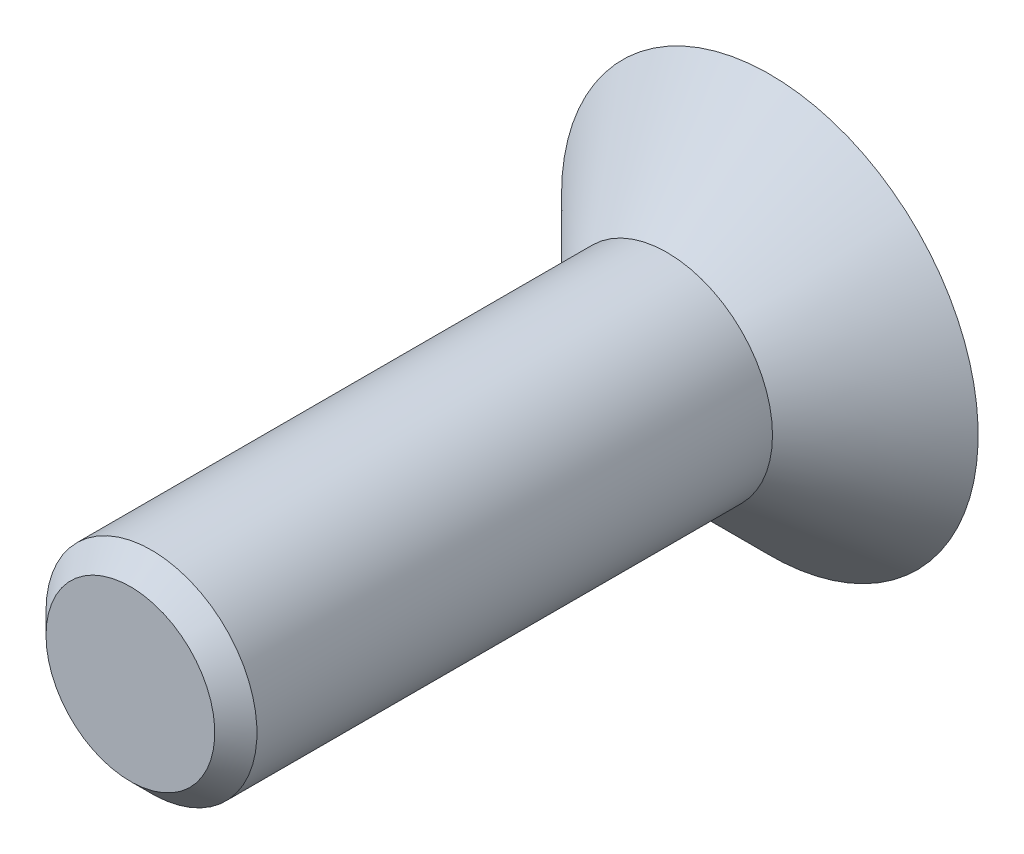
from build123d import *

# Parameters (mm, degrees)
FENTE1_DEPTH    = 3.8
ESQUISSE3_W     = 4
ESQUISSE3_H     = 20.35
CHANFREIN1_SIZE = 0.8


with BuildPart() as part:
    # Esquisse1 → Base-R_volution (revolve)
    with BuildSketch(Plane(origin=(0, 0, 0), x_dir=(1, 0, 0), z_dir=(0, 1, 0)), mode=Mode.PRIVATE) as base_r_volution_sk:
        Polygon((4, 0), (7.9, 3.9), (0, 3.9), (0, 0), align=None)
    revolve(base_r_volution_sk.sketch.rotate(Axis((0, 0, 0), (0, 0, -1)), 180), axis=Axis((0, 0, 0), (0, 0, -1)))

    # Esquisse2 → fente1 (cut)
    with BuildSketch(Plane.XY.offset(-3.9)):
        Polygon((2.5, -1.443375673), (2.5, 1.443375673), (0, 2.886751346), (-2.5, 1.443375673), (-2.5, -1.443375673), (0, -2.886751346), align=None)
    extrude(amount=FENTE1_DEPTH, mode=Mode.SUBTRACT)

    # Esquisse3 → Boss.-R_vol.1 (revolve)
    with BuildSketch(Plane(origin=(0, 0, 0), x_dir=(1, 0, 0), z_dir=(0, 1, 0)), mode=Mode.PRIVATE) as boss_r_vol_1_sk:
        with Locations((2, -10.175)):
            Rectangle(ESQUISSE3_W, ESQUISSE3_H)
    revolve(boss_r_vol_1_sk.sketch.rotate(Axis((0, 0, 0), (0, 0, 1)), 180), axis=Axis((0, 0, 0), (0, 0, 1)))

    # Chanfrein1
    chanfrein1_edges = [part.edges().sort_by_distance(p)[0] for p in [
        (4, 0, 20.35),
    ]]
    chamfer(chanfrein1_edges, length=CHANFREIN1_SIZE)


solid = part.part
